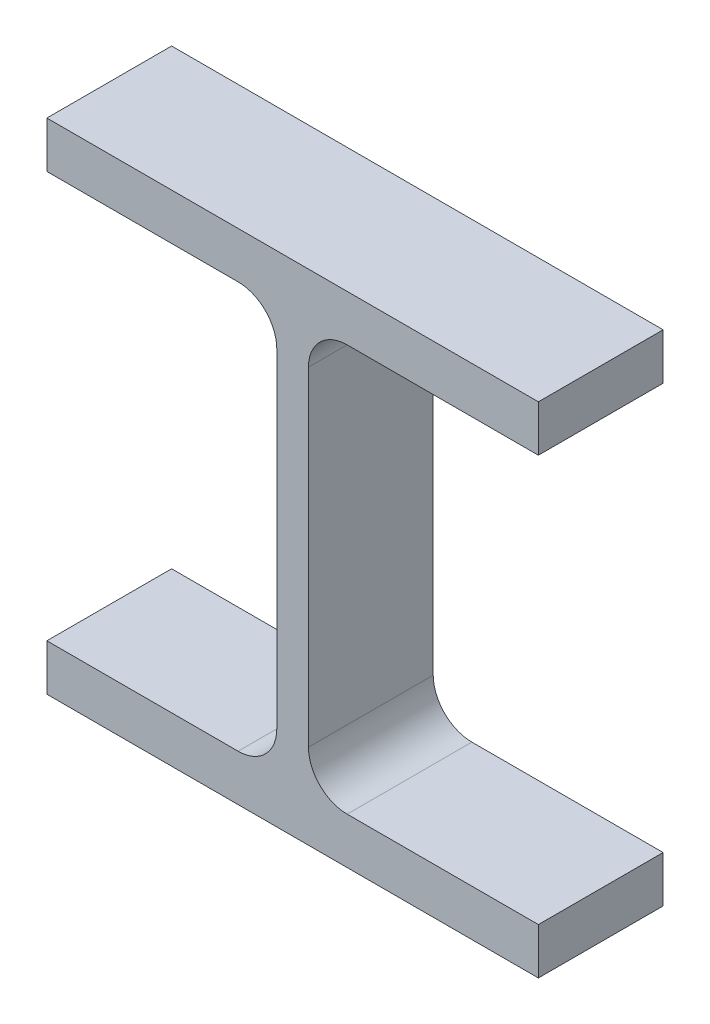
ISO-10303-21;
HEADER;
FILE_DESCRIPTION(('STEP AP214'),'2;1');
FILE_NAME('part.step','',(''),(''),'','','');
FILE_SCHEMA(('AUTOMOTIVE_DESIGN { 1 0 10303 214 1 1 1 1 }'));
ENDSEC;
DATA;
#1=APPLICATION_CONTEXT('core data for automotive mechanical design processes');
#2=APPLICATION_PROTOCOL_DEFINITION('international standard','automotive_design',2000,#1);
#3=PRODUCT_CONTEXT('',#1,'mechanical');
#4=PRODUCT('Part','Part','',(#3));
#5=PRODUCT_RELATED_PRODUCT_CATEGORY('part','',(#4));
#6=PRODUCT_DEFINITION_FORMATION('','',#4);
#7=PRODUCT_DEFINITION_CONTEXT('part definition',#1,'design');
#8=PRODUCT_DEFINITION('design','',#6,#7);
#9=PRODUCT_DEFINITION_SHAPE('','',#8);
#10=(LENGTH_UNIT() NAMED_UNIT(*) SI_UNIT(.MILLI.,.METRE.));
#11=(NAMED_UNIT(*) PLANE_ANGLE_UNIT() SI_UNIT($,.RADIAN.));
#12=(NAMED_UNIT(*) SI_UNIT($,.STERADIAN.) SOLID_ANGLE_UNIT());
#13=UNCERTAINTY_MEASURE_WITH_UNIT(LENGTH_MEASURE(1.E-05),#10,'distance_accuracy_value','');
#14=(GEOMETRIC_REPRESENTATION_CONTEXT(3) GLOBAL_UNCERTAINTY_ASSIGNED_CONTEXT((#13)) GLOBAL_UNIT_ASSIGNED_CONTEXT((#10,
#11,#12)) REPRESENTATION_CONTEXT('',''));
#15=CARTESIAN_POINT('',(0.,0.,0.));
#16=DIRECTION('',(0.,0.,1.));
#17=DIRECTION('',(1.,0.,0.));
#18=AXIS2_PLACEMENT_3D('',#15,#16,#17);
#19=CARTESIAN_POINT('',(100.076,0.,-12.7));
#20=DIRECTION('',(0.,-1.,0.));
#21=DIRECTION('',(0.,0.,-1.));
#22=AXIS2_PLACEMENT_3D('',#19,#20,#21);
#23=PLANE('',#22);
#24=DIRECTION('',(1.,0.,0.));
#25=VECTOR('',#24,1.);
#26=CARTESIAN_POINT('',(100.076,0.,12.7));
#27=LINE('',#26,#25);
#28=CARTESIAN_POINT('',(0.,0.,12.7));
#29=VERTEX_POINT('',#28);
#30=CARTESIAN_POINT('',(100.076,0.,12.7));
#31=VERTEX_POINT('',#30);
#32=EDGE_CURVE('E183',#29,#31,#27,.T.);
#33=ORIENTED_EDGE('',*,*,#32,.F.);
#34=DIRECTION('',(0.,0.,1.));
#35=VECTOR('',#34,1.);
#36=CARTESIAN_POINT('',(0.,0.,-12.7));
#37=LINE('',#36,#35);
#38=CARTESIAN_POINT('',(0.,0.,-12.7));
#39=VERTEX_POINT('',#38);
#40=EDGE_CURVE('E11',#39,#29,#37,.T.);
#41=ORIENTED_EDGE('',*,*,#40,.F.);
#42=DIRECTION('',(1.,0.,0.));
#43=VECTOR('',#42,1.);
#44=CARTESIAN_POINT('',(100.076,0.,-12.7));
#45=LINE('',#44,#43);
#46=CARTESIAN_POINT('',(100.076,0.,-12.7));
#47=VERTEX_POINT('',#46);
#48=EDGE_CURVE('E226',#39,#47,#45,.T.);
#49=ORIENTED_EDGE('',*,*,#48,.T.);
#50=DIRECTION('',(0.,0.,1.));
#51=VECTOR('',#50,1.);
#52=CARTESIAN_POINT('',(100.076,0.,-12.7));
#53=LINE('',#52,#51);
#54=EDGE_CURVE('E45',#47,#31,#53,.T.);
#55=ORIENTED_EDGE('',*,*,#54,.T.);
#56=EDGE_LOOP('',(#33,#41,#49,#55));
#57=FACE_BOUND('',#56,.T.);
#58=ADVANCED_FACE('F39',(#57),#23,.T.);
#59=CARTESIAN_POINT('',(0.,0.,-12.7));
#60=DIRECTION('',(-1.,0.,0.));
#61=DIRECTION('',(0.,-1.,0.));
#62=AXIS2_PLACEMENT_3D('',#59,#60,#61);
#63=PLANE('',#62);
#64=DIRECTION('',(0.,-1.,0.));
#65=VECTOR('',#64,1.);
#66=CARTESIAN_POINT('',(0.,0.,12.7));
#67=LINE('',#66,#65);
#68=CARTESIAN_POINT('',(0.,9.42339999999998,12.7));
#69=VERTEX_POINT('',#68);
#70=EDGE_CURVE('E228',#69,#29,#67,.T.);
#71=ORIENTED_EDGE('',*,*,#70,.F.);
#72=DIRECTION('',(0.,0.,1.));
#73=VECTOR('',#72,1.);
#74=CARTESIAN_POINT('',(0.,9.42339999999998,-12.7));
#75=LINE('',#74,#73);
#76=CARTESIAN_POINT('',(0.,9.42339999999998,-12.7));
#77=VERTEX_POINT('',#76);
#78=EDGE_CURVE('E48',#77,#69,#75,.T.);
#79=ORIENTED_EDGE('',*,*,#78,.F.);
#80=DIRECTION('',(0.,-1.,0.));
#81=VECTOR('',#80,1.);
#82=CARTESIAN_POINT('',(0.,0.,-12.7));
#83=LINE('',#82,#81);
#84=EDGE_CURVE('E172',#77,#39,#83,.T.);
#85=ORIENTED_EDGE('',*,*,#84,.T.);
#86=ORIENTED_EDGE('',*,*,#40,.T.);
#87=EDGE_LOOP('',(#71,#79,#85,#86));
#88=FACE_BOUND('',#87,.T.);
#89=ADVANCED_FACE('F257',(#88),#63,.T.);
#90=CARTESIAN_POINT('',(0.,9.42339999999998,-12.7));
#91=DIRECTION('',(0.,1.,0.));
#92=DIRECTION('',(-1.,0.,0.));
#93=AXIS2_PLACEMENT_3D('',#90,#91,#92);
#94=PLANE('',#93);
#95=DIRECTION('',(-1.,0.,0.));
#96=VECTOR('',#95,1.);
#97=CARTESIAN_POINT('',(0.,9.42339999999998,12.7));
#98=LINE('',#97,#96);
#99=CARTESIAN_POINT('',(38.9382,9.42339999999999,12.7));
#100=VERTEX_POINT('',#99);
#101=EDGE_CURVE('E163',#100,#69,#98,.T.);
#102=ORIENTED_EDGE('',*,*,#101,.F.);
#103=DIRECTION('',(0.,0.,1.));
#104=VECTOR('',#103,1.);
#105=CARTESIAN_POINT('',(38.9382,9.42339999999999,-12.7));
#106=LINE('',#105,#104);
#107=CARTESIAN_POINT('',(38.9382,9.42339999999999,-12.7));
#108=VERTEX_POINT('',#107);
#109=EDGE_CURVE('E158',#108,#100,#106,.T.);
#110=ORIENTED_EDGE('',*,*,#109,.F.);
#111=DIRECTION('',(-1.,0.,0.));
#112=VECTOR('',#111,1.);
#113=CARTESIAN_POINT('',(0.,9.42339999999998,-12.7));
#114=LINE('',#113,#112);
#115=EDGE_CURVE('E160',#108,#77,#114,.T.);
#116=ORIENTED_EDGE('',*,*,#115,.T.);
#117=ORIENTED_EDGE('',*,*,#78,.T.);
#118=EDGE_LOOP('',(#102,#110,#116,#117));
#119=FACE_BOUND('',#118,.T.);
#120=ADVANCED_FACE('F157',(#119),#94,.T.);
#121=CARTESIAN_POINT('',(38.9382,17.2974,-12.7));
#122=DIRECTION('',(0.,0.,1.));
#123=DIRECTION('',(1.,0.,0.));
#124=AXIS2_PLACEMENT_3D('',#121,#122,#123);
#125=CYLINDRICAL_SURFACE('',#124,7.874);
#126=CARTESIAN_POINT('',(38.9382,17.2974,12.7));
#127=DIRECTION('',(0.,0.,-1.));
#128=DIRECTION('',(1.,0.,0.));
#129=AXIS2_PLACEMENT_3D('',#126,#127,#128);
#130=CIRCLE('',#129,7.874);
#131=CARTESIAN_POINT('',(46.8122,17.2974,12.7));
#132=VERTEX_POINT('',#131);
#133=EDGE_CURVE('E222',#132,#100,#130,.T.);
#134=ORIENTED_EDGE('',*,*,#133,.F.);
#135=DIRECTION('',(0.,0.,1.));
#136=VECTOR('',#135,1.);
#137=CARTESIAN_POINT('',(46.8122,17.2974,-12.7));
#138=LINE('',#137,#136);
#139=CARTESIAN_POINT('',(46.8122,17.2974,-12.7));
#140=VERTEX_POINT('',#139);
#141=EDGE_CURVE('E168',#140,#132,#138,.T.);
#142=ORIENTED_EDGE('',*,*,#141,.F.);
#143=CARTESIAN_POINT('',(38.9382,17.2974,-12.7));
#144=DIRECTION('',(0.,0.,-1.));
#145=DIRECTION('',(1.,0.,0.));
#146=AXIS2_PLACEMENT_3D('',#143,#144,#145);
#147=CIRCLE('',#146,7.874);
#148=EDGE_CURVE('E175',#140,#108,#147,.T.);
#149=ORIENTED_EDGE('',*,*,#148,.T.);
#150=ORIENTED_EDGE('',*,*,#109,.T.);
#151=EDGE_LOOP('',(#134,#142,#149,#150));
#152=FACE_BOUND('',#151,.T.);
#153=ADVANCED_FACE('F176',(#152),#125,.F.);
#154=CARTESIAN_POINT('',(46.8122,17.2974,-12.7));
#155=DIRECTION('',(-1.,0.,0.));
#156=DIRECTION('',(0.,-1.,0.));
#157=AXIS2_PLACEMENT_3D('',#154,#155,#156);
#158=PLANE('',#157);
#159=DIRECTION('',(0.,-1.,0.));
#160=VECTOR('',#159,1.);
#161=CARTESIAN_POINT('',(46.8122,17.2974,12.7));
#162=LINE('',#161,#160);
#163=CARTESIAN_POINT('',(46.8122,84.3026,12.7));
#164=VERTEX_POINT('',#163);
#165=EDGE_CURVE('E216',#164,#132,#162,.T.);
#166=ORIENTED_EDGE('',*,*,#165,.F.);
#167=DIRECTION('',(0.,0.,1.));
#168=VECTOR('',#167,1.);
#169=CARTESIAN_POINT('',(46.8122,84.3026,-12.7));
#170=LINE('',#169,#168);
#171=CARTESIAN_POINT('',(46.8122,84.3026,-12.7));
#172=VERTEX_POINT('',#171);
#173=EDGE_CURVE('E235',#172,#164,#170,.T.);
#174=ORIENTED_EDGE('',*,*,#173,.F.);
#175=DIRECTION('',(0.,-1.,0.));
#176=VECTOR('',#175,1.);
#177=CARTESIAN_POINT('',(46.8122,17.2974,-12.7));
#178=LINE('',#177,#176);
#179=EDGE_CURVE('E180',#172,#140,#178,.T.);
#180=ORIENTED_EDGE('',*,*,#179,.T.);
#181=ORIENTED_EDGE('',*,*,#141,.T.);
#182=EDGE_LOOP('',(#166,#174,#180,#181));
#183=FACE_BOUND('',#182,.T.);
#184=ADVANCED_FACE('F270',(#183),#158,.T.);
#185=CARTESIAN_POINT('',(38.9382,84.3026,-12.7));
#186=DIRECTION('',(0.,0.,1.));
#187=DIRECTION('',(1.,0.,0.));
#188=AXIS2_PLACEMENT_3D('',#185,#186,#187);
#189=CYLINDRICAL_SURFACE('',#188,7.87399999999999);
#190=CARTESIAN_POINT('',(38.9382,84.3026,12.7));
#191=DIRECTION('',(0.,0.,-1.));
#192=DIRECTION('',(1.,0.,0.));
#193=AXIS2_PLACEMENT_3D('',#190,#191,#192);
#194=CIRCLE('',#193,7.87399999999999);
#195=CARTESIAN_POINT('',(38.9382,92.1766,12.7));
#196=VERTEX_POINT('',#195);
#197=EDGE_CURVE('E219',#196,#164,#194,.T.);
#198=ORIENTED_EDGE('',*,*,#197,.F.);
#199=DIRECTION('',(0.,0.,1.));
#200=VECTOR('',#199,1.);
#201=CARTESIAN_POINT('',(38.9382,92.1766,-12.7));
#202=LINE('',#201,#200);
#203=CARTESIAN_POINT('',(38.9382,92.1766,-12.7));
#204=VERTEX_POINT('',#203);
#205=EDGE_CURVE('E234',#204,#196,#202,.T.);
#206=ORIENTED_EDGE('',*,*,#205,.F.);
#207=CARTESIAN_POINT('',(38.9382,84.3026,-12.7));
#208=DIRECTION('',(0.,0.,-1.));
#209=DIRECTION('',(1.,0.,0.));
#210=AXIS2_PLACEMENT_3D('',#207,#208,#209);
#211=CIRCLE('',#210,7.87399999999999);
#212=EDGE_CURVE('E177',#204,#172,#211,.T.);
#213=ORIENTED_EDGE('',*,*,#212,.T.);
#214=ORIENTED_EDGE('',*,*,#173,.T.);
#215=EDGE_LOOP('',(#198,#206,#213,#214));
#216=FACE_BOUND('',#215,.T.);
#217=ADVANCED_FACE('F275',(#216),#189,.F.);
#218=CARTESIAN_POINT('',(38.9382,92.1766,-12.7));
#219=DIRECTION('',(0.,-1.,0.));
#220=DIRECTION('',(1.,0.,0.));
#221=AXIS2_PLACEMENT_3D('',#218,#219,#220);
#222=PLANE('',#221);
#223=DIRECTION('',(1.,0.,0.));
#224=VECTOR('',#223,1.);
#225=CARTESIAN_POINT('',(38.9382,92.1766,12.7));
#226=LINE('',#225,#224);
#227=CARTESIAN_POINT('',(0.,92.1766,12.7));
#228=VERTEX_POINT('',#227);
#229=EDGE_CURVE('E211',#228,#196,#226,.T.);
#230=ORIENTED_EDGE('',*,*,#229,.F.);
#231=DIRECTION('',(0.,0.,1.));
#232=VECTOR('',#231,1.);
#233=CARTESIAN_POINT('',(0.,92.1766,-12.7));
#234=LINE('',#233,#232);
#235=CARTESIAN_POINT('',(0.,92.1766,-12.7));
#236=VERTEX_POINT('',#235);
#237=EDGE_CURVE('E236',#236,#228,#234,.T.);
#238=ORIENTED_EDGE('',*,*,#237,.F.);
#239=DIRECTION('',(1.,0.,0.));
#240=VECTOR('',#239,1.);
#241=CARTESIAN_POINT('',(38.9382,92.1766,-12.7));
#242=LINE('',#241,#240);
#243=EDGE_CURVE('E454',#236,#204,#242,.T.);
#244=ORIENTED_EDGE('',*,*,#243,.T.);
#245=ORIENTED_EDGE('',*,*,#205,.T.);
#246=EDGE_LOOP('',(#230,#238,#244,#245));
#247=FACE_BOUND('',#246,.T.);
#248=ADVANCED_FACE('F277',(#247),#222,.T.);
#249=CARTESIAN_POINT('',(0.,92.1766,-12.7));
#250=DIRECTION('',(-1.,0.,0.));
#251=DIRECTION('',(0.,-1.,0.));
#252=AXIS2_PLACEMENT_3D('',#249,#250,#251);
#253=PLANE('',#252);
#254=DIRECTION('',(0.,-1.,0.));
#255=VECTOR('',#254,1.);
#256=CARTESIAN_POINT('',(0.,92.1766,12.7));
#257=LINE('',#256,#255);
#258=CARTESIAN_POINT('',(0.,101.6,12.7));
#259=VERTEX_POINT('',#258);
#260=EDGE_CURVE('E212',#259,#228,#257,.T.);
#261=ORIENTED_EDGE('',*,*,#260,.F.);
#262=DIRECTION('',(0.,0.,1.));
#263=VECTOR('',#262,1.);
#264=CARTESIAN_POINT('',(0.,101.6,-12.7));
#265=LINE('',#264,#263);
#266=CARTESIAN_POINT('',(0.,101.6,-12.7));
#267=VERTEX_POINT('',#266);
#268=EDGE_CURVE('E238',#267,#259,#265,.T.);
#269=ORIENTED_EDGE('',*,*,#268,.F.);
#270=DIRECTION('',(0.,-1.,0.));
#271=VECTOR('',#270,1.);
#272=CARTESIAN_POINT('',(0.,92.1766,-12.7));
#273=LINE('',#272,#271);
#274=EDGE_CURVE('E446',#267,#236,#273,.T.);
#275=ORIENTED_EDGE('',*,*,#274,.T.);
#276=ORIENTED_EDGE('',*,*,#237,.T.);
#277=EDGE_LOOP('',(#261,#269,#275,#276));
#278=FACE_BOUND('',#277,.T.);
#279=ADVANCED_FACE('F278',(#278),#253,.T.);
#280=CARTESIAN_POINT('',(0.,101.6,-12.7));
#281=DIRECTION('',(0.,1.,0.));
#282=DIRECTION('',(0.,0.,1.));
#283=AXIS2_PLACEMENT_3D('',#280,#281,#282);
#284=PLANE('',#283);
#285=DIRECTION('',(-1.,0.,0.));
#286=VECTOR('',#285,1.);
#287=CARTESIAN_POINT('',(0.,101.6,12.7));
#288=LINE('',#287,#286);
#289=CARTESIAN_POINT('',(100.076,101.6,12.7));
#290=VERTEX_POINT('',#289);
#291=EDGE_CURVE('E206',#290,#259,#288,.T.);
#292=ORIENTED_EDGE('',*,*,#291,.F.);
#293=DIRECTION('',(0.,0.,1.));
#294=VECTOR('',#293,1.);
#295=CARTESIAN_POINT('',(100.076,101.6,-12.7));
#296=LINE('',#295,#294);
#297=CARTESIAN_POINT('',(100.076,101.6,-12.7));
#298=VERTEX_POINT('',#297);
#299=EDGE_CURVE('E239',#298,#290,#296,.T.);
#300=ORIENTED_EDGE('',*,*,#299,.F.);
#301=DIRECTION('',(-1.,0.,0.));
#302=VECTOR('',#301,1.);
#303=CARTESIAN_POINT('',(0.,101.6,-12.7));
#304=LINE('',#303,#302);
#305=EDGE_CURVE('E456',#298,#267,#304,.T.);
#306=ORIENTED_EDGE('',*,*,#305,.T.);
#307=ORIENTED_EDGE('',*,*,#268,.T.);
#308=EDGE_LOOP('',(#292,#300,#306,#307));
#309=FACE_BOUND('',#308,.T.);
#310=ADVANCED_FACE('F285',(#309),#284,.T.);
#311=CARTESIAN_POINT('',(100.076,101.6,-12.7));
#312=DIRECTION('',(1.,0.,0.));
#313=DIRECTION('',(0.,1.,0.));
#314=AXIS2_PLACEMENT_3D('',#311,#312,#313);
#315=PLANE('',#314);
#316=DIRECTION('',(0.,1.,0.));
#317=VECTOR('',#316,1.);
#318=CARTESIAN_POINT('',(100.076,101.6,12.7));
#319=LINE('',#318,#317);
#320=CARTESIAN_POINT('',(100.076,92.1766,12.7));
#321=VERTEX_POINT('',#320);
#322=EDGE_CURVE('E201',#321,#290,#319,.T.);
#323=ORIENTED_EDGE('',*,*,#322,.F.);
#324=DIRECTION('',(0.,0.,1.));
#325=VECTOR('',#324,1.);
#326=CARTESIAN_POINT('',(100.076,92.1766,-12.7));
#327=LINE('',#326,#325);
#328=CARTESIAN_POINT('',(100.076,92.1766,-12.7));
#329=VERTEX_POINT('',#328);
#330=EDGE_CURVE('E245',#329,#321,#327,.T.);
#331=ORIENTED_EDGE('',*,*,#330,.F.);
#332=DIRECTION('',(0.,1.,0.));
#333=VECTOR('',#332,1.);
#334=CARTESIAN_POINT('',(100.076,101.6,-12.7));
#335=LINE('',#334,#333);
#336=EDGE_CURVE('E445',#329,#298,#335,.T.);
#337=ORIENTED_EDGE('',*,*,#336,.T.);
#338=ORIENTED_EDGE('',*,*,#299,.T.);
#339=EDGE_LOOP('',(#323,#331,#337,#338));
#340=FACE_BOUND('',#339,.T.);
#341=ADVANCED_FACE('F287',(#340),#315,.T.);
#342=CARTESIAN_POINT('',(100.076,92.1766,-12.7));
#343=DIRECTION('',(0.,-1.,0.));
#344=DIRECTION('',(0.,0.,-1.));
#345=AXIS2_PLACEMENT_3D('',#342,#343,#344);
#346=PLANE('',#345);
#347=DIRECTION('',(1.,0.,0.));
#348=VECTOR('',#347,1.);
#349=CARTESIAN_POINT('',(100.076,92.1766,12.7));
#350=LINE('',#349,#348);
#351=CARTESIAN_POINT('',(61.1378,92.1766,12.7));
#352=VERTEX_POINT('',#351);
#353=EDGE_CURVE('E204',#352,#321,#350,.T.);
#354=ORIENTED_EDGE('',*,*,#353,.F.);
#355=DIRECTION('',(0.,0.,1.));
#356=VECTOR('',#355,1.);
#357=CARTESIAN_POINT('',(61.1378,92.1766,-12.7));
#358=LINE('',#357,#356);
#359=CARTESIAN_POINT('',(61.1378,92.1766,-12.7));
#360=VERTEX_POINT('',#359);
#361=EDGE_CURVE('E242',#360,#352,#358,.T.);
#362=ORIENTED_EDGE('',*,*,#361,.F.);
#363=DIRECTION('',(1.,0.,0.));
#364=VECTOR('',#363,1.);
#365=CARTESIAN_POINT('',(100.076,92.1766,-12.7));
#366=LINE('',#365,#364);
#367=EDGE_CURVE('E438',#360,#329,#366,.T.);
#368=ORIENTED_EDGE('',*,*,#367,.T.);
#369=ORIENTED_EDGE('',*,*,#330,.T.);
#370=EDGE_LOOP('',(#354,#362,#368,#369));
#371=FACE_BOUND('',#370,.T.);
#372=ADVANCED_FACE('F292',(#371),#346,.T.);
#373=CARTESIAN_POINT('',(61.1378,84.3026,-12.7));
#374=DIRECTION('',(0.,0.,1.));
#375=DIRECTION('',(1.,0.,0.));
#376=AXIS2_PLACEMENT_3D('',#373,#374,#375);
#377=CYLINDRICAL_SURFACE('',#376,7.874);
#378=CARTESIAN_POINT('',(61.1378,84.3026,12.7));
#379=DIRECTION('',(0.,0.,-1.));
#380=DIRECTION('',(1.,0.,0.));
#381=AXIS2_PLACEMENT_3D('',#378,#379,#380);
#382=CIRCLE('',#381,7.874);
#383=CARTESIAN_POINT('',(53.2638,84.3026,12.7));
#384=VERTEX_POINT('',#383);
#385=EDGE_CURVE('E200',#384,#352,#382,.T.);
#386=ORIENTED_EDGE('',*,*,#385,.F.);
#387=DIRECTION('',(0.,0.,1.));
#388=VECTOR('',#387,1.);
#389=CARTESIAN_POINT('',(53.2638,84.3026,-12.7));
#390=LINE('',#389,#388);
#391=CARTESIAN_POINT('',(53.2638,84.3026,-12.7));
#392=VERTEX_POINT('',#391);
#393=EDGE_CURVE('E246',#392,#384,#390,.T.);
#394=ORIENTED_EDGE('',*,*,#393,.F.);
#395=CARTESIAN_POINT('',(61.1378,84.3026,-12.7));
#396=DIRECTION('',(0.,0.,-1.));
#397=DIRECTION('',(1.,0.,0.));
#398=AXIS2_PLACEMENT_3D('',#395,#396,#397);
#399=CIRCLE('',#398,7.874);
#400=EDGE_CURVE('E465',#392,#360,#399,.T.);
#401=ORIENTED_EDGE('',*,*,#400,.T.);
#402=ORIENTED_EDGE('',*,*,#361,.T.);
#403=EDGE_LOOP('',(#386,#394,#401,#402));
#404=FACE_BOUND('',#403,.T.);
#405=ADVANCED_FACE('F298',(#404),#377,.F.);
#406=CARTESIAN_POINT('',(53.2638,84.3026,-12.7));
#407=DIRECTION('',(1.,0.,0.));
#408=DIRECTION('',(0.,0.,-1.));
#409=AXIS2_PLACEMENT_3D('',#406,#407,#408);
#410=PLANE('',#409);
#411=DIRECTION('',(0.,1.,0.));
#412=VECTOR('',#411,1.);
#413=CARTESIAN_POINT('',(53.2638,84.3026,12.7));
#414=LINE('',#413,#412);
#415=CARTESIAN_POINT('',(53.2638,17.2974,12.7));
#416=VERTEX_POINT('',#415);
#417=EDGE_CURVE('E198',#416,#384,#414,.T.);
#418=ORIENTED_EDGE('',*,*,#417,.F.);
#419=DIRECTION('',(0.,0.,1.));
#420=VECTOR('',#419,1.);
#421=CARTESIAN_POINT('',(53.2638,17.2974,-12.7));
#422=LINE('',#421,#420);
#423=CARTESIAN_POINT('',(53.2638,17.2974,-12.7));
#424=VERTEX_POINT('',#423);
#425=EDGE_CURVE('E247',#424,#416,#422,.T.);
#426=ORIENTED_EDGE('',*,*,#425,.F.);
#427=DIRECTION('',(0.,1.,0.));
#428=VECTOR('',#427,1.);
#429=CARTESIAN_POINT('',(53.2638,84.3026,-12.7));
#430=LINE('',#429,#428);
#431=EDGE_CURVE('E431',#424,#392,#430,.T.);
#432=ORIENTED_EDGE('',*,*,#431,.T.);
#433=ORIENTED_EDGE('',*,*,#393,.T.);
#434=EDGE_LOOP('',(#418,#426,#432,#433));
#435=FACE_BOUND('',#434,.T.);
#436=ADVANCED_FACE('F297',(#435),#410,.T.);
#437=CARTESIAN_POINT('',(61.1378,17.2974,-12.7));
#438=DIRECTION('',(0.,0.,1.));
#439=DIRECTION('',(1.,0.,0.));
#440=AXIS2_PLACEMENT_3D('',#437,#438,#439);
#441=CYLINDRICAL_SURFACE('',#440,7.874);
#442=CARTESIAN_POINT('',(61.1378,17.2974,12.7));
#443=DIRECTION('',(0.,0.,-1.));
#444=DIRECTION('',(1.,0.,0.));
#445=AXIS2_PLACEMENT_3D('',#442,#443,#444);
#446=CIRCLE('',#445,7.874);
#447=CARTESIAN_POINT('',(61.1378,9.42339999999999,12.7));
#448=VERTEX_POINT('',#447);
#449=EDGE_CURVE('E194',#448,#416,#446,.T.);
#450=ORIENTED_EDGE('',*,*,#449,.F.);
#451=DIRECTION('',(0.,0.,1.));
#452=VECTOR('',#451,1.);
#453=CARTESIAN_POINT('',(61.1378,9.42339999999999,-12.7));
#454=LINE('',#453,#452);
#455=CARTESIAN_POINT('',(61.1378,9.42339999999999,-12.7));
#456=VERTEX_POINT('',#455);
#457=EDGE_CURVE('E249',#456,#448,#454,.T.);
#458=ORIENTED_EDGE('',*,*,#457,.F.);
#459=CARTESIAN_POINT('',(61.1378,17.2974,-12.7));
#460=DIRECTION('',(0.,0.,-1.));
#461=DIRECTION('',(1.,0.,0.));
#462=AXIS2_PLACEMENT_3D('',#459,#460,#461);
#463=CIRCLE('',#462,7.874);
#464=EDGE_CURVE('E430',#456,#424,#463,.T.);
#465=ORIENTED_EDGE('',*,*,#464,.T.);
#466=ORIENTED_EDGE('',*,*,#425,.T.);
#467=EDGE_LOOP('',(#450,#458,#465,#466));
#468=FACE_BOUND('',#467,.T.);
#469=ADVANCED_FACE('F302',(#468),#441,.F.);
#470=CARTESIAN_POINT('',(61.1378,9.4234,-12.7));
#471=DIRECTION('',(0.,1.,0.));
#472=DIRECTION('',(-1.,0.,0.));
#473=AXIS2_PLACEMENT_3D('',#470,#471,#472);
#474=PLANE('',#473);
#475=DIRECTION('',(-1.,0.,0.));
#476=VECTOR('',#475,1.);
#477=CARTESIAN_POINT('',(61.1378,9.4234,12.7));
#478=LINE('',#477,#476);
#479=CARTESIAN_POINT('',(100.076,9.42339999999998,12.7));
#480=VERTEX_POINT('',#479);
#481=EDGE_CURVE('E188',#480,#448,#478,.T.);
#482=ORIENTED_EDGE('',*,*,#481,.F.);
#483=DIRECTION('',(0.,0.,1.));
#484=VECTOR('',#483,1.);
#485=CARTESIAN_POINT('',(100.076,9.42339999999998,-12.7));
#486=LINE('',#485,#484);
#487=CARTESIAN_POINT('',(100.076,9.42339999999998,-12.7));
#488=VERTEX_POINT('',#487);
#489=EDGE_CURVE('E252',#488,#480,#486,.T.);
#490=ORIENTED_EDGE('',*,*,#489,.F.);
#491=DIRECTION('',(-1.,0.,0.));
#492=VECTOR('',#491,1.);
#493=CARTESIAN_POINT('',(61.1378,9.4234,-12.7));
#494=LINE('',#493,#492);
#495=EDGE_CURVE('E466',#488,#456,#494,.T.);
#496=ORIENTED_EDGE('',*,*,#495,.T.);
#497=ORIENTED_EDGE('',*,*,#457,.T.);
#498=EDGE_LOOP('',(#482,#490,#496,#497));
#499=FACE_BOUND('',#498,.T.);
#500=ADVANCED_FACE('F308',(#499),#474,.T.);
#501=CARTESIAN_POINT('',(100.076,9.42339999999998,-12.7));
#502=DIRECTION('',(1.,0.,0.));
#503=DIRECTION('',(0.,0.,-1.));
#504=AXIS2_PLACEMENT_3D('',#501,#502,#503);
#505=PLANE('',#504);
#506=DIRECTION('',(0.,1.,0.));
#507=VECTOR('',#506,1.);
#508=CARTESIAN_POINT('',(100.076,9.42339999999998,12.7));
#509=LINE('',#508,#507);
#510=EDGE_CURVE('E190',#31,#480,#509,.T.);
#511=ORIENTED_EDGE('',*,*,#510,.F.);
#512=ORIENTED_EDGE('',*,*,#54,.F.);
#513=DIRECTION('',(0.,1.,0.));
#514=VECTOR('',#513,1.);
#515=CARTESIAN_POINT('',(100.076,9.42339999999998,-12.7));
#516=LINE('',#515,#514);
#517=EDGE_CURVE('E468',#47,#488,#516,.T.);
#518=ORIENTED_EDGE('',*,*,#517,.T.);
#519=ORIENTED_EDGE('',*,*,#489,.T.);
#520=EDGE_LOOP('',(#511,#512,#518,#519));
#521=FACE_BOUND('',#520,.T.);
#522=ADVANCED_FACE('F254',(#521),#505,.T.);
#523=CARTESIAN_POINT('',(38.9382,17.2974,-12.7));
#524=DIRECTION('',(0.,0.,1.));
#525=DIRECTION('',(1.,0.,0.));
#526=AXIS2_PLACEMENT_3D('',#523,#524,#525);
#527=PLANE('',#526);
#528=ORIENTED_EDGE('',*,*,#48,.F.);
#529=ORIENTED_EDGE('',*,*,#84,.F.);
#530=ORIENTED_EDGE('',*,*,#115,.F.);
#531=ORIENTED_EDGE('',*,*,#148,.F.);
#532=ORIENTED_EDGE('',*,*,#179,.F.);
#533=ORIENTED_EDGE('',*,*,#212,.F.);
#534=ORIENTED_EDGE('',*,*,#243,.F.);
#535=ORIENTED_EDGE('',*,*,#274,.F.);
#536=ORIENTED_EDGE('',*,*,#305,.F.);
#537=ORIENTED_EDGE('',*,*,#336,.F.);
#538=ORIENTED_EDGE('',*,*,#367,.F.);
#539=ORIENTED_EDGE('',*,*,#400,.F.);
#540=ORIENTED_EDGE('',*,*,#431,.F.);
#541=ORIENTED_EDGE('',*,*,#464,.F.);
#542=ORIENTED_EDGE('',*,*,#495,.F.);
#543=ORIENTED_EDGE('',*,*,#517,.F.);
#544=EDGE_LOOP('',(#528,#529,#530,#531,#532,#533,#534,#535,#536,#537,#538,#539,#540,#541,#542,#543));
#545=FACE_BOUND('',#544,.T.);
#546=ADVANCED_FACE('F167',(#545),#527,.F.);
#547=CARTESIAN_POINT('',(38.9382,17.2974,12.7));
#548=DIRECTION('',(0.,0.,1.));
#549=DIRECTION('',(1.,0.,0.));
#550=AXIS2_PLACEMENT_3D('',#547,#548,#549);
#551=PLANE('',#550);
#552=ORIENTED_EDGE('',*,*,#32,.T.);
#553=ORIENTED_EDGE('',*,*,#510,.T.);
#554=ORIENTED_EDGE('',*,*,#481,.T.);
#555=ORIENTED_EDGE('',*,*,#449,.T.);
#556=ORIENTED_EDGE('',*,*,#417,.T.);
#557=ORIENTED_EDGE('',*,*,#385,.T.);
#558=ORIENTED_EDGE('',*,*,#353,.T.);
#559=ORIENTED_EDGE('',*,*,#322,.T.);
#560=ORIENTED_EDGE('',*,*,#291,.T.);
#561=ORIENTED_EDGE('',*,*,#260,.T.);
#562=ORIENTED_EDGE('',*,*,#229,.T.);
#563=ORIENTED_EDGE('',*,*,#197,.T.);
#564=ORIENTED_EDGE('',*,*,#165,.T.);
#565=ORIENTED_EDGE('',*,*,#133,.T.);
#566=ORIENTED_EDGE('',*,*,#101,.T.);
#567=ORIENTED_EDGE('',*,*,#70,.T.);
#568=EDGE_LOOP('',(#552,#553,#554,#555,#556,#557,#558,#559,#560,#561,#562,#563,#564,#565,#566,#567));
#569=FACE_BOUND('',#568,.T.);
#570=ADVANCED_FACE('F253',(#569),#551,.T.);
#571=CLOSED_SHELL('',(#58,#89,#120,#153,#184,#217,#248,#279,#310,#341,#372,#405,#436,#469,#500,
#522,#546,#570));
#572=MANIFOLD_SOLID_BREP('B2',#571);
#573=ADVANCED_BREP_SHAPE_REPRESENTATION('',(#18,#572),#14);
#574=SHAPE_DEFINITION_REPRESENTATION(#9,#573);
ENDSEC;
END-ISO-10303-21;
